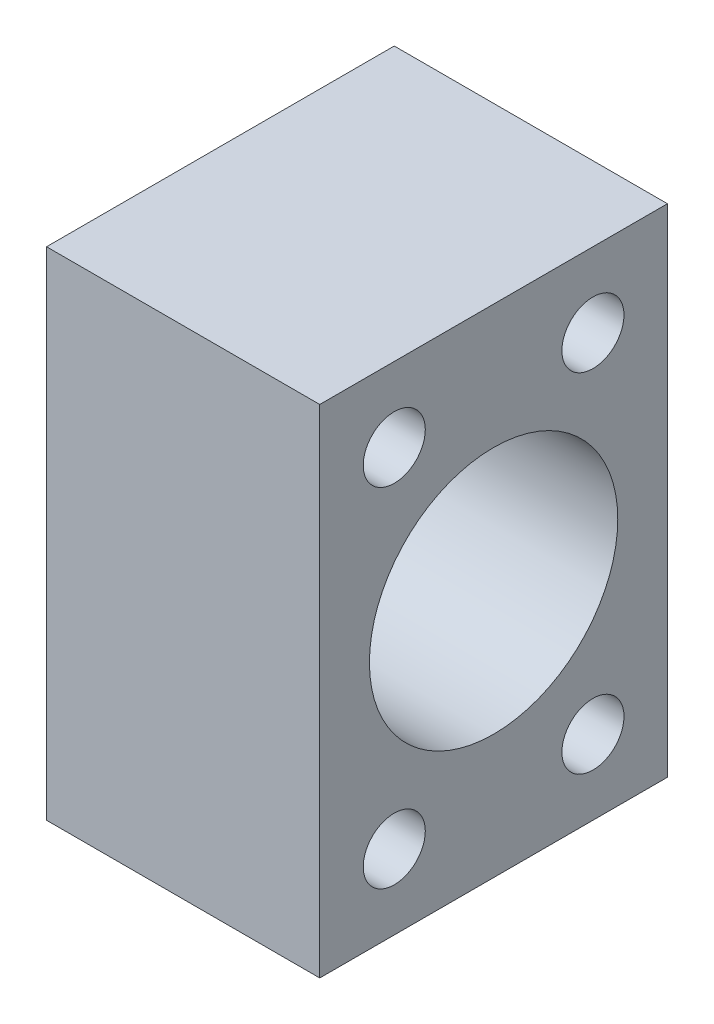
from build123d import *

# Parameters (mm, degrees)
SKETCH1_W               = 44.45
SKETCH1_H               = 63.5
SKETCH1_R               = 15.875
EXTRUDE1_DEPTH          = 17.4625
F_3_8_16_TAPPED_HOLE1_D = 7.9375
MIRROR2_COPY_1_D        = 7.9375


with BuildPart() as part:
    # Sketch1 → Extrude1 (new, symmetric)
    with BuildSketch(Plane(origin=(0, 0, 0), x_dir=(0, 0, -1), z_dir=(1, 0, 0))):
        Rectangle(SKETCH1_W, SKETCH1_H)
        Circle(SKETCH1_R, mode=Mode.SUBTRACT)
    extrude(amount=EXTRUDE1_DEPTH, both=True)

    # 3_8-16 Tapped Hole1 (through all)
    with Locations(Plane(origin=(17.4625, 22.225, 12.7), x_dir=(0, 0, 1), z_dir=(1, 0, 0))):
        with Locations((0, 0)):
            f_3_8_16_tapped_hole1 = Hole(F_3_8_16_TAPPED_HOLE1_D / 2)

    # Mirror1: 3_8-16 Tapped Hole1 across plane
    add(f_3_8_16_tapped_hole1.mirror(Plane.XY), mode=Mode.SUBTRACT)

    # Mirror2: 3_8-16 Tapped Hole1 across plane
    add(f_3_8_16_tapped_hole1.mirror(Plane.ZX), mode=Mode.SUBTRACT)

    # Mirror2 copy 1 (through all)
    with Locations(Plane(origin=(17.4625, -22.225, -12.7), x_dir=(0, 0, -1), z_dir=(1, 0, 0))):
        with Locations((0, 0)):
            Hole(MIRROR2_COPY_1_D / 2)


solid = part.part
